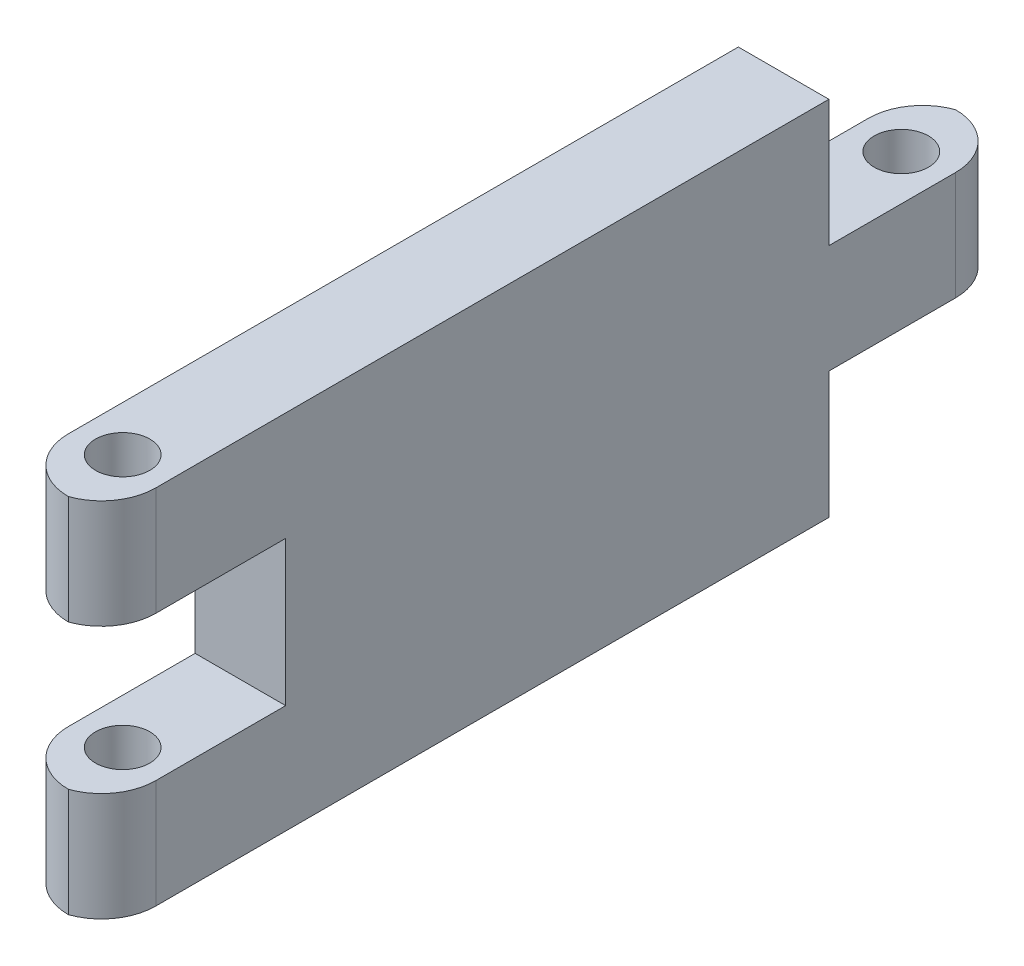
ISO-10303-21;
HEADER;
FILE_DESCRIPTION(('STEP AP214'),'2;1');
FILE_NAME('part.step','',(''),(''),'','','');
FILE_SCHEMA(('AUTOMOTIVE_DESIGN { 1 0 10303 214 1 1 1 1 }'));
ENDSEC;
DATA;
#1=APPLICATION_CONTEXT('core data for automotive mechanical design processes');
#2=APPLICATION_PROTOCOL_DEFINITION('international standard','automotive_design',2000,#1);
#3=PRODUCT_CONTEXT('',#1,'mechanical');
#4=PRODUCT('Part','Part','',(#3));
#5=PRODUCT_RELATED_PRODUCT_CATEGORY('part','',(#4));
#6=PRODUCT_DEFINITION_FORMATION('','',#4);
#7=PRODUCT_DEFINITION_CONTEXT('part definition',#1,'design');
#8=PRODUCT_DEFINITION('design','',#6,#7);
#9=PRODUCT_DEFINITION_SHAPE('','',#8);
#10=(LENGTH_UNIT() NAMED_UNIT(*) SI_UNIT(.MILLI.,.METRE.));
#11=(NAMED_UNIT(*) PLANE_ANGLE_UNIT() SI_UNIT($,.RADIAN.));
#12=(NAMED_UNIT(*) SI_UNIT($,.STERADIAN.) SOLID_ANGLE_UNIT());
#13=UNCERTAINTY_MEASURE_WITH_UNIT(LENGTH_MEASURE(1.E-05),#10,'distance_accuracy_value','');
#14=(GEOMETRIC_REPRESENTATION_CONTEXT(3) GLOBAL_UNCERTAINTY_ASSIGNED_CONTEXT((#13)) GLOBAL_UNIT_ASSIGNED_CONTEXT((#10,
#11,#12)) REPRESENTATION_CONTEXT('',''));
#15=CARTESIAN_POINT('',(0.,0.,0.));
#16=DIRECTION('',(0.,0.,1.));
#17=DIRECTION('',(1.,0.,0.));
#18=AXIS2_PLACEMENT_3D('',#15,#16,#17);
#19=CARTESIAN_POINT('',(5.,0.,-30.));
#20=DIRECTION('',(0.,0.,1.));
#21=DIRECTION('',(1.,0.,0.));
#22=AXIS2_PLACEMENT_3D('',#19,#20,#21);
#23=PLANE('',#22);
#24=DIRECTION('',(1.,0.,0.));
#25=VECTOR('',#24,1.);
#26=CARTESIAN_POINT('',(5.,13.,-30.));
#27=LINE('',#26,#25);
#28=CARTESIAN_POINT('',(0.,13.,-30.));
#29=VERTEX_POINT('',#28);
#30=CARTESIAN_POINT('',(5.,13.,-30.));
#31=VERTEX_POINT('',#30);
#32=EDGE_CURVE('E176',#29,#31,#27,.T.);
#33=ORIENTED_EDGE('',*,*,#32,.F.);
#34=DIRECTION('',(0.,1.,0.));
#35=VECTOR('',#34,1.);
#36=CARTESIAN_POINT('',(0.,0.,-30.));
#37=LINE('',#36,#35);
#38=CARTESIAN_POINT('',(0.,20.,-30.));
#39=VERTEX_POINT('',#38);
#40=EDGE_CURVE('E171',#29,#39,#37,.T.);
#41=ORIENTED_EDGE('',*,*,#40,.T.);
#42=DIRECTION('',(-1.,0.,0.));
#43=VECTOR('',#42,1.);
#44=CARTESIAN_POINT('',(5.,20.,-30.));
#45=LINE('',#44,#43);
#46=CARTESIAN_POINT('',(5.,20.,-30.));
#47=VERTEX_POINT('',#46);
#48=EDGE_CURVE('E242',#47,#39,#45,.T.);
#49=ORIENTED_EDGE('',*,*,#48,.F.);
#50=DIRECTION('',(0.,1.,0.));
#51=VECTOR('',#50,1.);
#52=CARTESIAN_POINT('',(5.,0.,-30.));
#53=LINE('',#52,#51);
#54=EDGE_CURVE('E234',#31,#47,#53,.T.);
#55=ORIENTED_EDGE('',*,*,#54,.F.);
#56=EDGE_LOOP('',(#33,#41,#49,#55));
#57=FACE_BOUND('',#56,.T.);
#58=ADVANCED_FACE('F43',(#57),#23,.F.);
#59=DIRECTION('',(-1.,0.,0.));
#60=VECTOR('',#59,1.);
#61=CARTESIAN_POINT('',(5.,7.,-30.));
#62=LINE('',#61,#60);
#63=CARTESIAN_POINT('',(5.,7.,-30.));
#64=VERTEX_POINT('',#63);
#65=CARTESIAN_POINT('',(0.,7.,-30.));
#66=VERTEX_POINT('',#65);
#67=EDGE_CURVE('E165',#64,#66,#62,.T.);
#68=ORIENTED_EDGE('',*,*,#67,.F.);
#69=CARTESIAN_POINT('',(5.,0.,-30.));
#70=VERTEX_POINT('',#69);
#71=EDGE_CURVE('E235',#70,#64,#53,.T.);
#72=ORIENTED_EDGE('',*,*,#71,.F.);
#73=DIRECTION('',(-1.,0.,0.));
#74=VECTOR('',#73,1.);
#75=CARTESIAN_POINT('',(5.,0.,-30.));
#76=LINE('',#75,#74);
#77=CARTESIAN_POINT('',(0.,0.,-30.));
#78=VERTEX_POINT('',#77);
#79=EDGE_CURVE('E168',#70,#78,#76,.T.);
#80=ORIENTED_EDGE('',*,*,#79,.T.);
#81=EDGE_CURVE('E152',#78,#66,#37,.T.);
#82=ORIENTED_EDGE('',*,*,#81,.T.);
#83=EDGE_LOOP('',(#68,#72,#80,#82));
#84=FACE_BOUND('',#83,.T.);
#85=ADVANCED_FACE('F163',(#84),#23,.F.);
#86=CARTESIAN_POINT('',(5.,0.,0.));
#87=DIRECTION('',(0.,0.,-1.));
#88=DIRECTION('',(-1.,0.,0.));
#89=AXIS2_PLACEMENT_3D('',#86,#87,#88);
#90=PLANE('',#89);
#91=DIRECTION('',(1.,0.,0.));
#92=VECTOR('',#91,1.);
#93=CARTESIAN_POINT('',(0.,14.,0.));
#94=LINE('',#93,#92);
#95=CARTESIAN_POINT('',(0.,14.,0.));
#96=VERTEX_POINT('',#95);
#97=CARTESIAN_POINT('',(5.,14.,0.));
#98=VERTEX_POINT('',#97);
#99=EDGE_CURVE('E206',#96,#98,#94,.T.);
#100=ORIENTED_EDGE('',*,*,#99,.F.);
#101=DIRECTION('',(0.,-1.,0.));
#102=VECTOR('',#101,1.);
#103=CARTESIAN_POINT('',(0.,0.,0.));
#104=LINE('',#103,#102);
#105=CARTESIAN_POINT('',(0.,6.,0.));
#106=VERTEX_POINT('',#105);
#107=EDGE_CURVE('E226',#96,#106,#104,.T.);
#108=ORIENTED_EDGE('',*,*,#107,.T.);
#109=DIRECTION('',(-1.,0.,0.));
#110=VECTOR('',#109,1.);
#111=CARTESIAN_POINT('',(0.,6.,0.));
#112=LINE('',#111,#110);
#113=CARTESIAN_POINT('',(5.,6.,0.));
#114=VERTEX_POINT('',#113);
#115=EDGE_CURVE('E216',#114,#106,#112,.T.);
#116=ORIENTED_EDGE('',*,*,#115,.F.);
#117=DIRECTION('',(0.,-1.,0.));
#118=VECTOR('',#117,1.);
#119=CARTESIAN_POINT('',(5.,0.,0.));
#120=LINE('',#119,#118);
#121=EDGE_CURVE('E227',#98,#114,#120,.T.);
#122=ORIENTED_EDGE('',*,*,#121,.F.);
#123=EDGE_LOOP('',(#100,#108,#116,#122));
#124=FACE_BOUND('',#123,.T.);
#125=ADVANCED_FACE('F355',(#124),#90,.F.);
#126=CARTESIAN_POINT('',(5.,0.,0.));
#127=DIRECTION('',(0.,1.,0.));
#128=DIRECTION('',(0.,0.,1.));
#129=AXIS2_PLACEMENT_3D('',#126,#127,#128);
#130=PLANE('',#129);
#131=CARTESIAN_POINT('',(2.5,0.,6.5));
#132=DIRECTION('',(0.,1.,0.));
#133=DIRECTION('',(0.,0.,1.));
#134=AXIS2_PLACEMENT_3D('',#131,#132,#133);
#135=CIRCLE('',#134,1.5);
#136=CARTESIAN_POINT('',(2.5,0.,8.));
#137=VERTEX_POINT('',#136);
#138=EDGE_CURVE('E193',#137,#137,#135,.T.);
#139=ORIENTED_EDGE('',*,*,#138,.T.);
#140=EDGE_LOOP('',(#139));
#141=FACE_BOUND('',#140,.T.);
#142=DIRECTION('',(0.,0.,-1.));
#143=VECTOR('',#142,1.);
#144=CARTESIAN_POINT('',(5.,0.,0.));
#145=LINE('',#144,#143);
#146=CARTESIAN_POINT('',(5.,0.,7.17157287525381));
#147=VERTEX_POINT('',#146);
#148=EDGE_CURVE('E231',#147,#70,#145,.T.);
#149=ORIENTED_EDGE('',*,*,#148,.F.);
#150=CARTESIAN_POINT('',(2.,0.,7.17157287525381));
#151=DIRECTION('',(0.,1.,0.));
#152=DIRECTION('',(0.,0.,1.));
#153=AXIS2_PLACEMENT_3D('',#150,#151,#152);
#154=CIRCLE('',#153,3.);
#155=CARTESIAN_POINT('',(3.,0.,10.));
#156=VERTEX_POINT('',#155);
#157=EDGE_CURVE('E277',#147,#156,#154,.F.);
#158=ORIENTED_EDGE('',*,*,#157,.T.);
#159=CARTESIAN_POINT('',(3.,0.,7.));
#160=DIRECTION('',(0.,1.,0.));
#161=DIRECTION('',(0.,0.,1.));
#162=AXIS2_PLACEMENT_3D('',#159,#160,#161);
#163=CIRCLE('',#162,3.);
#164=CARTESIAN_POINT('',(0.,0.,7.));
#165=VERTEX_POINT('',#164);
#166=EDGE_CURVE('E261',#156,#165,#163,.F.);
#167=ORIENTED_EDGE('',*,*,#166,.T.);
#168=DIRECTION('',(0.,0.,-1.));
#169=VECTOR('',#168,1.);
#170=CARTESIAN_POINT('',(0.,0.,0.));
#171=LINE('',#170,#169);
#172=EDGE_CURVE('E246',#165,#78,#171,.T.);
#173=ORIENTED_EDGE('',*,*,#172,.T.);
#174=ORIENTED_EDGE('',*,*,#79,.F.);
#175=EDGE_LOOP('',(#149,#158,#167,#173,#174));
#176=FACE_BOUND('',#175,.T.);
#177=ADVANCED_FACE('F368',(#141,#176),#130,.F.);
#178=CARTESIAN_POINT('',(5.,20.,0.));
#179=DIRECTION('',(0.,-1.,0.));
#180=DIRECTION('',(0.,0.,-1.));
#181=AXIS2_PLACEMENT_3D('',#178,#179,#180);
#182=PLANE('',#181);
#183=CARTESIAN_POINT('',(2.5,20.,6.5));
#184=DIRECTION('',(0.,-1.,0.));
#185=DIRECTION('',(0.,0.,-1.));
#186=AXIS2_PLACEMENT_3D('',#183,#184,#185);
#187=CIRCLE('',#186,1.5);
#188=CARTESIAN_POINT('',(2.5,20.,5.));
#189=VERTEX_POINT('',#188);
#190=EDGE_CURVE('E202',#189,#189,#187,.T.);
#191=ORIENTED_EDGE('',*,*,#190,.T.);
#192=EDGE_LOOP('',(#191));
#193=FACE_BOUND('',#192,.T.);
#194=CARTESIAN_POINT('',(3.,20.,7.));
#195=DIRECTION('',(0.,-1.,0.));
#196=DIRECTION('',(0.,0.,-1.));
#197=AXIS2_PLACEMENT_3D('',#194,#195,#196);
#198=CIRCLE('',#197,3.);
#199=CARTESIAN_POINT('',(0.,20.,7.));
#200=VERTEX_POINT('',#199);
#201=CARTESIAN_POINT('',(3.,20.,10.));
#202=VERTEX_POINT('',#201);
#203=EDGE_CURVE('E290',#200,#202,#198,.F.);
#204=ORIENTED_EDGE('',*,*,#203,.T.);
#205=CARTESIAN_POINT('',(2.,20.,7.17157287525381));
#206=DIRECTION('',(0.,-1.,0.));
#207=DIRECTION('',(0.,0.,-1.));
#208=AXIS2_PLACEMENT_3D('',#205,#206,#207);
#209=CIRCLE('',#208,3.);
#210=CARTESIAN_POINT('',(5.,20.,7.17157287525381));
#211=VERTEX_POINT('',#210);
#212=EDGE_CURVE('E300',#202,#211,#209,.F.);
#213=ORIENTED_EDGE('',*,*,#212,.T.);
#214=DIRECTION('',(0.,0.,1.));
#215=VECTOR('',#214,1.);
#216=CARTESIAN_POINT('',(5.,20.,0.));
#217=LINE('',#216,#215);
#218=EDGE_CURVE('E238',#47,#211,#217,.T.);
#219=ORIENTED_EDGE('',*,*,#218,.F.);
#220=ORIENTED_EDGE('',*,*,#48,.T.);
#221=DIRECTION('',(0.,0.,1.));
#222=VECTOR('',#221,1.);
#223=CARTESIAN_POINT('',(0.,20.,0.));
#224=LINE('',#223,#222);
#225=EDGE_CURVE('E170',#39,#200,#224,.T.);
#226=ORIENTED_EDGE('',*,*,#225,.T.);
#227=EDGE_LOOP('',(#204,#213,#219,#220,#226));
#228=FACE_BOUND('',#227,.T.);
#229=ADVANCED_FACE('F332',(#193,#228),#182,.F.);
#230=CARTESIAN_POINT('',(5.,0.,0.));
#231=DIRECTION('',(-1.,0.,0.));
#232=DIRECTION('',(0.,0.,1.));
#233=AXIS2_PLACEMENT_3D('',#230,#231,#232);
#234=PLANE('',#233);
#235=DIRECTION('',(0.,0.,1.));
#236=VECTOR('',#235,1.);
#237=CARTESIAN_POINT('',(5.,7.,-40.));
#238=LINE('',#237,#236);
#239=CARTESIAN_POINT('',(5.,7.,-37.));
#240=VERTEX_POINT('',#239);
#241=EDGE_CURVE('E157',#240,#64,#238,.T.);
#242=ORIENTED_EDGE('',*,*,#241,.F.);
#243=DIRECTION('',(0.,-1.,0.));
#244=VECTOR('',#243,1.);
#245=CARTESIAN_POINT('',(5.,13.,-37.));
#246=LINE('',#245,#244);
#247=CARTESIAN_POINT('',(5.,13.,-37.));
#248=VERTEX_POINT('',#247);
#249=EDGE_CURVE('E313',#240,#248,#246,.F.);
#250=ORIENTED_EDGE('',*,*,#249,.T.);
#251=DIRECTION('',(0.,0.,1.));
#252=VECTOR('',#251,1.);
#253=CARTESIAN_POINT('',(5.,13.,-40.));
#254=LINE('',#253,#252);
#255=EDGE_CURVE('E182',#248,#31,#254,.T.);
#256=ORIENTED_EDGE('',*,*,#255,.T.);
#257=ORIENTED_EDGE('',*,*,#54,.T.);
#258=ORIENTED_EDGE('',*,*,#218,.T.);
#259=DIRECTION('',(0.,-1.,0.));
#260=VECTOR('',#259,1.);
#261=CARTESIAN_POINT('',(5.,0.,7.17157287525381));
#262=LINE('',#261,#260);
#263=CARTESIAN_POINT('',(5.,14.,7.17157287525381));
#264=VERTEX_POINT('',#263);
#265=EDGE_CURVE('E293',#211,#264,#262,.T.);
#266=ORIENTED_EDGE('',*,*,#265,.T.);
#267=DIRECTION('',(0.,0.,-1.));
#268=VECTOR('',#267,1.);
#269=CARTESIAN_POINT('',(5.,14.,10.));
#270=LINE('',#269,#268);
#271=EDGE_CURVE('E213',#264,#98,#270,.T.);
#272=ORIENTED_EDGE('',*,*,#271,.T.);
#273=ORIENTED_EDGE('',*,*,#121,.T.);
#274=DIRECTION('',(0.,0.,-1.));
#275=VECTOR('',#274,1.);
#276=CARTESIAN_POINT('',(5.,6.,10.));
#277=LINE('',#276,#275);
#278=CARTESIAN_POINT('',(5.,6.,7.17157287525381));
#279=VERTEX_POINT('',#278);
#280=EDGE_CURVE('E223',#279,#114,#277,.T.);
#281=ORIENTED_EDGE('',*,*,#280,.F.);
#282=DIRECTION('',(0.,-1.,0.));
#283=VECTOR('',#282,1.);
#284=CARTESIAN_POINT('',(5.,0.,7.17157287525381));
#285=LINE('',#284,#283);
#286=EDGE_CURVE('E274',#279,#147,#285,.T.);
#287=ORIENTED_EDGE('',*,*,#286,.T.);
#288=ORIENTED_EDGE('',*,*,#148,.T.);
#289=ORIENTED_EDGE('',*,*,#71,.T.);
#290=EDGE_LOOP('',(#242,#250,#256,#257,#258,#266,#272,#273,#281,#287,#288,#289));
#291=FACE_BOUND('',#290,.T.);
#292=ADVANCED_FACE('F345',(#291),#234,.F.);
#293=CARTESIAN_POINT('',(0.,0.,0.));
#294=DIRECTION('',(-1.,0.,0.));
#295=DIRECTION('',(0.,0.,1.));
#296=AXIS2_PLACEMENT_3D('',#293,#294,#295);
#297=PLANE('',#296);
#298=DIRECTION('',(0.,0.,1.));
#299=VECTOR('',#298,1.);
#300=CARTESIAN_POINT('',(0.,13.,-40.));
#301=LINE('',#300,#299);
#302=CARTESIAN_POINT('',(0.,13.,-37.1715728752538));
#303=VERTEX_POINT('',#302);
#304=EDGE_CURVE('E158',#303,#29,#301,.T.);
#305=ORIENTED_EDGE('',*,*,#304,.F.);
#306=DIRECTION('',(0.,1.,0.));
#307=VECTOR('',#306,1.);
#308=CARTESIAN_POINT('',(0.,7.,-37.1715728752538));
#309=LINE('',#308,#307);
#310=CARTESIAN_POINT('',(0.,7.,-37.1715728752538));
#311=VERTEX_POINT('',#310);
#312=EDGE_CURVE('E53',#303,#311,#309,.F.);
#313=ORIENTED_EDGE('',*,*,#312,.T.);
#314=DIRECTION('',(0.,0.,1.));
#315=VECTOR('',#314,1.);
#316=CARTESIAN_POINT('',(0.,7.,-40.));
#317=LINE('',#316,#315);
#318=EDGE_CURVE('E148',#311,#66,#317,.T.);
#319=ORIENTED_EDGE('',*,*,#318,.T.);
#320=ORIENTED_EDGE('',*,*,#81,.F.);
#321=ORIENTED_EDGE('',*,*,#172,.F.);
#322=DIRECTION('',(0.,-1.,0.));
#323=VECTOR('',#322,1.);
#324=CARTESIAN_POINT('',(0.,6.,7.));
#325=LINE('',#324,#323);
#326=CARTESIAN_POINT('',(0.,6.,7.));
#327=VERTEX_POINT('',#326);
#328=EDGE_CURVE('E264',#165,#327,#325,.F.);
#329=ORIENTED_EDGE('',*,*,#328,.T.);
#330=DIRECTION('',(0.,0.,-1.));
#331=VECTOR('',#330,1.);
#332=CARTESIAN_POINT('',(0.,6.,10.));
#333=LINE('',#332,#331);
#334=EDGE_CURVE('E220',#327,#106,#333,.T.);
#335=ORIENTED_EDGE('',*,*,#334,.T.);
#336=ORIENTED_EDGE('',*,*,#107,.F.);
#337=DIRECTION('',(0.,0.,-1.));
#338=VECTOR('',#337,1.);
#339=CARTESIAN_POINT('',(0.,14.,10.));
#340=LINE('',#339,#338);
#341=CARTESIAN_POINT('',(0.,14.,7.));
#342=VERTEX_POINT('',#341);
#343=EDGE_CURVE('E210',#342,#96,#340,.T.);
#344=ORIENTED_EDGE('',*,*,#343,.F.);
#345=DIRECTION('',(0.,-1.,0.));
#346=VECTOR('',#345,1.);
#347=CARTESIAN_POINT('',(0.,20.,7.));
#348=LINE('',#347,#346);
#349=EDGE_CURVE('E287',#342,#200,#348,.F.);
#350=ORIENTED_EDGE('',*,*,#349,.T.);
#351=ORIENTED_EDGE('',*,*,#225,.F.);
#352=ORIENTED_EDGE('',*,*,#40,.F.);
#353=EDGE_LOOP('',(#305,#313,#319,#320,#321,#329,#335,#336,#344,#350,#351,#352));
#354=FACE_BOUND('',#353,.T.);
#355=ADVANCED_FACE('F150',(#354),#297,.T.);
#356=CARTESIAN_POINT('',(0.,6.,10.));
#357=DIRECTION('',(0.,-1.,0.));
#358=DIRECTION('',(0.,0.,-1.));
#359=AXIS2_PLACEMENT_3D('',#356,#357,#358);
#360=PLANE('',#359);
#361=CARTESIAN_POINT('',(2.5,6.,6.5));
#362=DIRECTION('',(0.,-1.,0.));
#363=DIRECTION('',(0.,0.,-1.));
#364=AXIS2_PLACEMENT_3D('',#361,#362,#363);
#365=CIRCLE('',#364,1.5);
#366=CARTESIAN_POINT('',(2.5,6.,5.));
#367=VERTEX_POINT('',#366);
#368=EDGE_CURVE('E198',#367,#367,#365,.T.);
#369=ORIENTED_EDGE('',*,*,#368,.T.);
#370=EDGE_LOOP('',(#369));
#371=FACE_BOUND('',#370,.T.);
#372=CARTESIAN_POINT('',(3.,6.,7.));
#373=DIRECTION('',(0.,-1.,0.));
#374=DIRECTION('',(0.,0.,-1.));
#375=AXIS2_PLACEMENT_3D('',#372,#373,#374);
#376=CIRCLE('',#375,3.);
#377=CARTESIAN_POINT('',(3.,6.,10.));
#378=VERTEX_POINT('',#377);
#379=EDGE_CURVE('E267',#327,#378,#376,.F.);
#380=ORIENTED_EDGE('',*,*,#379,.T.);
#381=CARTESIAN_POINT('',(2.,6.,7.17157287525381));
#382=DIRECTION('',(0.,-1.,0.));
#383=DIRECTION('',(0.,0.,-1.));
#384=AXIS2_PLACEMENT_3D('',#381,#382,#383);
#385=CIRCLE('',#384,3.);
#386=EDGE_CURVE('E271',#378,#279,#385,.F.);
#387=ORIENTED_EDGE('',*,*,#386,.T.);
#388=ORIENTED_EDGE('',*,*,#280,.T.);
#389=ORIENTED_EDGE('',*,*,#115,.T.);
#390=ORIENTED_EDGE('',*,*,#334,.F.);
#391=EDGE_LOOP('',(#380,#387,#388,#389,#390));
#392=FACE_BOUND('',#391,.T.);
#393=ADVANCED_FACE('F358',(#371,#392),#360,.F.);
#394=CARTESIAN_POINT('',(0.,14.,10.));
#395=DIRECTION('',(0.,1.,0.));
#396=DIRECTION('',(0.,0.,1.));
#397=AXIS2_PLACEMENT_3D('',#394,#395,#396);
#398=PLANE('',#397);
#399=CARTESIAN_POINT('',(2.5,14.,6.5));
#400=DIRECTION('',(0.,1.,0.));
#401=DIRECTION('',(0.,0.,1.));
#402=AXIS2_PLACEMENT_3D('',#399,#400,#401);
#403=CIRCLE('',#402,1.5);
#404=CARTESIAN_POINT('',(2.5,14.,8.));
#405=VERTEX_POINT('',#404);
#406=EDGE_CURVE('E197',#405,#405,#403,.T.);
#407=ORIENTED_EDGE('',*,*,#406,.T.);
#408=EDGE_LOOP('',(#407));
#409=FACE_BOUND('',#408,.T.);
#410=ORIENTED_EDGE('',*,*,#271,.F.);
#411=CARTESIAN_POINT('',(2.,14.,7.17157287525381));
#412=DIRECTION('',(0.,1.,0.));
#413=DIRECTION('',(0.,0.,1.));
#414=AXIS2_PLACEMENT_3D('',#411,#412,#413);
#415=CIRCLE('',#414,3.);
#416=CARTESIAN_POINT('',(3.,14.,10.));
#417=VERTEX_POINT('',#416);
#418=EDGE_CURVE('E297',#264,#417,#415,.F.);
#419=ORIENTED_EDGE('',*,*,#418,.T.);
#420=CARTESIAN_POINT('',(3.,14.,7.));
#421=DIRECTION('',(0.,1.,0.));
#422=DIRECTION('',(0.,0.,1.));
#423=AXIS2_PLACEMENT_3D('',#420,#421,#422);
#424=CIRCLE('',#423,3.);
#425=EDGE_CURVE('E284',#417,#342,#424,.F.);
#426=ORIENTED_EDGE('',*,*,#425,.T.);
#427=ORIENTED_EDGE('',*,*,#343,.T.);
#428=ORIENTED_EDGE('',*,*,#99,.T.);
#429=EDGE_LOOP('',(#410,#419,#426,#427,#428));
#430=FACE_BOUND('',#429,.T.);
#431=ADVANCED_FACE('F349',(#409,#430),#398,.F.);
#432=CARTESIAN_POINT('',(3.,0.,7.));
#433=DIRECTION('',(0.,1.,0.));
#434=DIRECTION('',(0.,0.,1.));
#435=AXIS2_PLACEMENT_3D('',#432,#433,#434);
#436=CYLINDRICAL_SURFACE('',#435,3.);
#437=ORIENTED_EDGE('',*,*,#379,.F.);
#438=ORIENTED_EDGE('',*,*,#328,.F.);
#439=ORIENTED_EDGE('',*,*,#166,.F.);
#440=DIRECTION('',(0.,-1.,0.));
#441=VECTOR('',#440,1.);
#442=CARTESIAN_POINT('',(3.,0.,10.));
#443=LINE('',#442,#441);
#444=EDGE_CURVE('E257',#378,#156,#443,.T.);
#445=ORIENTED_EDGE('',*,*,#444,.F.);
#446=EDGE_LOOP('',(#437,#438,#439,#445));
#447=FACE_BOUND('',#446,.T.);
#448=ADVANCED_FACE('F371',(#447),#436,.T.);
#449=CARTESIAN_POINT('',(2.,0.,7.17157287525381));
#450=DIRECTION('',(0.,-1.,0.));
#451=DIRECTION('',(0.,0.,-1.));
#452=AXIS2_PLACEMENT_3D('',#449,#450,#451);
#453=CYLINDRICAL_SURFACE('',#452,3.);
#454=ORIENTED_EDGE('',*,*,#157,.F.);
#455=ORIENTED_EDGE('',*,*,#286,.F.);
#456=ORIENTED_EDGE('',*,*,#386,.F.);
#457=ORIENTED_EDGE('',*,*,#444,.T.);
#458=EDGE_LOOP('',(#454,#455,#456,#457));
#459=FACE_BOUND('',#458,.T.);
#460=ADVANCED_FACE('F364',(#459),#453,.T.);
#461=CARTESIAN_POINT('',(3.,0.,7.));
#462=DIRECTION('',(0.,1.,0.));
#463=DIRECTION('',(0.,0.,1.));
#464=AXIS2_PLACEMENT_3D('',#461,#462,#463);
#465=CYLINDRICAL_SURFACE('',#464,3.);
#466=ORIENTED_EDGE('',*,*,#203,.F.);
#467=ORIENTED_EDGE('',*,*,#349,.F.);
#468=ORIENTED_EDGE('',*,*,#425,.F.);
#469=DIRECTION('',(0.,-1.,0.));
#470=VECTOR('',#469,1.);
#471=CARTESIAN_POINT('',(3.,14.,10.));
#472=LINE('',#471,#470);
#473=EDGE_CURVE('E280',#202,#417,#472,.T.);
#474=ORIENTED_EDGE('',*,*,#473,.F.);
#475=EDGE_LOOP('',(#466,#467,#468,#474));
#476=FACE_BOUND('',#475,.T.);
#477=ADVANCED_FACE('F339',(#476),#465,.T.);
#478=CARTESIAN_POINT('',(2.,0.,7.17157287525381));
#479=DIRECTION('',(0.,-1.,0.));
#480=DIRECTION('',(0.,0.,-1.));
#481=AXIS2_PLACEMENT_3D('',#478,#479,#480);
#482=CYLINDRICAL_SURFACE('',#481,3.);
#483=ORIENTED_EDGE('',*,*,#212,.F.);
#484=ORIENTED_EDGE('',*,*,#473,.T.);
#485=ORIENTED_EDGE('',*,*,#418,.F.);
#486=ORIENTED_EDGE('',*,*,#265,.F.);
#487=EDGE_LOOP('',(#483,#484,#485,#486));
#488=FACE_BOUND('',#487,.T.);
#489=ADVANCED_FACE('F347',(#488),#482,.T.);
#490=CARTESIAN_POINT('',(2.5,0.,6.5));
#491=DIRECTION('',(0.,1.,0.));
#492=DIRECTION('',(0.,0.,1.));
#493=AXIS2_PLACEMENT_3D('',#490,#491,#492);
#494=CYLINDRICAL_SURFACE('',#493,1.5);
#495=ORIENTED_EDGE('',*,*,#406,.F.);
#496=EDGE_LOOP('',(#495));
#497=FACE_BOUND('',#496,.T.);
#498=ORIENTED_EDGE('',*,*,#190,.F.);
#499=EDGE_LOOP('',(#498));
#500=FACE_BOUND('',#499,.T.);
#501=ADVANCED_FACE('F410',(#497,#500),#494,.F.);
#502=ORIENTED_EDGE('',*,*,#138,.F.);
#503=EDGE_LOOP('',(#502));
#504=FACE_BOUND('',#503,.T.);
#505=ORIENTED_EDGE('',*,*,#368,.F.);
#506=EDGE_LOOP('',(#505));
#507=FACE_BOUND('',#506,.T.);
#508=ADVANCED_FACE('F414',(#504,#507),#494,.F.);
#509=CARTESIAN_POINT('',(5.,7.,-40.));
#510=DIRECTION('',(0.,1.,0.));
#511=DIRECTION('',(0.,0.,1.));
#512=AXIS2_PLACEMENT_3D('',#509,#510,#511);
#513=PLANE('',#512);
#514=CARTESIAN_POINT('',(2.5,7.,-36.5));
#515=DIRECTION('',(0.,1.,0.));
#516=DIRECTION('',(0.,0.,1.));
#517=AXIS2_PLACEMENT_3D('',#514,#515,#516);
#518=CIRCLE('',#517,1.5);
#519=CARTESIAN_POINT('',(2.5,7.,-38.));
#520=VERTEX_POINT('',#519);
#521=EDGE_CURVE('E177',#520,#520,#518,.T.);
#522=ORIENTED_EDGE('',*,*,#521,.T.);
#523=EDGE_LOOP('',(#522));
#524=FACE_BOUND('',#523,.T.);
#525=ORIENTED_EDGE('',*,*,#318,.F.);
#526=CARTESIAN_POINT('',(3.,7.,-37.1715728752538));
#527=DIRECTION('',(0.,1.,0.));
#528=DIRECTION('',(0.,0.,1.));
#529=AXIS2_PLACEMENT_3D('',#526,#527,#528);
#530=CIRCLE('',#529,3.);
#531=CARTESIAN_POINT('',(2.,7.,-40.));
#532=VERTEX_POINT('',#531);
#533=EDGE_CURVE('E11',#311,#532,#530,.F.);
#534=ORIENTED_EDGE('',*,*,#533,.T.);
#535=CARTESIAN_POINT('',(2.,7.,-37.));
#536=DIRECTION('',(0.,1.,0.));
#537=DIRECTION('',(0.,0.,1.));
#538=AXIS2_PLACEMENT_3D('',#535,#536,#537);
#539=CIRCLE('',#538,3.);
#540=EDGE_CURVE('E310',#532,#240,#539,.F.);
#541=ORIENTED_EDGE('',*,*,#540,.T.);
#542=ORIENTED_EDGE('',*,*,#241,.T.);
#543=ORIENTED_EDGE('',*,*,#67,.T.);
#544=EDGE_LOOP('',(#525,#534,#541,#542,#543));
#545=FACE_BOUND('',#544,.T.);
#546=ADVANCED_FACE('F173',(#524,#545),#513,.F.);
#547=CARTESIAN_POINT('',(5.,13.,-40.));
#548=DIRECTION('',(0.,-1.,0.));
#549=DIRECTION('',(0.,0.,-1.));
#550=AXIS2_PLACEMENT_3D('',#547,#548,#549);
#551=PLANE('',#550);
#552=CARTESIAN_POINT('',(2.5,13.,-36.5));
#553=DIRECTION('',(0.,-1.,0.));
#554=DIRECTION('',(0.,0.,-1.));
#555=AXIS2_PLACEMENT_3D('',#552,#553,#554);
#556=CIRCLE('',#555,1.5);
#557=CARTESIAN_POINT('',(2.5,13.,-38.));
#558=VERTEX_POINT('',#557);
#559=EDGE_CURVE('E47',#558,#558,#556,.T.);
#560=ORIENTED_EDGE('',*,*,#559,.T.);
#561=EDGE_LOOP('',(#560));
#562=FACE_BOUND('',#561,.T.);
#563=CARTESIAN_POINT('',(2.,13.,-37.));
#564=DIRECTION('',(0.,-1.,0.));
#565=DIRECTION('',(0.,0.,-1.));
#566=AXIS2_PLACEMENT_3D('',#563,#564,#565);
#567=CIRCLE('',#566,3.);
#568=CARTESIAN_POINT('',(2.,13.,-40.));
#569=VERTEX_POINT('',#568);
#570=EDGE_CURVE('E316',#248,#569,#567,.F.);
#571=ORIENTED_EDGE('',*,*,#570,.T.);
#572=CARTESIAN_POINT('',(3.,13.,-37.1715728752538));
#573=DIRECTION('',(0.,-1.,0.));
#574=DIRECTION('',(0.,0.,-1.));
#575=AXIS2_PLACEMENT_3D('',#572,#573,#574);
#576=CIRCLE('',#575,3.);
#577=EDGE_CURVE('E67',#569,#303,#576,.F.);
#578=ORIENTED_EDGE('',*,*,#577,.T.);
#579=ORIENTED_EDGE('',*,*,#304,.T.);
#580=ORIENTED_EDGE('',*,*,#32,.T.);
#581=ORIENTED_EDGE('',*,*,#255,.F.);
#582=EDGE_LOOP('',(#571,#578,#579,#580,#581));
#583=FACE_BOUND('',#582,.T.);
#584=ADVANCED_FACE('F379',(#562,#583),#551,.F.);
#585=CARTESIAN_POINT('',(2.,0.,-37.));
#586=DIRECTION('',(0.,1.,0.));
#587=DIRECTION('',(0.,0.,1.));
#588=AXIS2_PLACEMENT_3D('',#585,#586,#587);
#589=CYLINDRICAL_SURFACE('',#588,3.);
#590=ORIENTED_EDGE('',*,*,#570,.F.);
#591=ORIENTED_EDGE('',*,*,#249,.F.);
#592=ORIENTED_EDGE('',*,*,#540,.F.);
#593=DIRECTION('',(0.,-1.,0.));
#594=VECTOR('',#593,1.);
#595=CARTESIAN_POINT('',(2.,7.,-40.));
#596=LINE('',#595,#594);
#597=EDGE_CURVE('E303',#569,#532,#596,.T.);
#598=ORIENTED_EDGE('',*,*,#597,.F.);
#599=EDGE_LOOP('',(#590,#591,#592,#598));
#600=FACE_BOUND('',#599,.T.);
#601=ADVANCED_FACE('F377',(#600),#589,.T.);
#602=CARTESIAN_POINT('',(3.,0.,-37.1715728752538));
#603=DIRECTION('',(0.,-1.,0.));
#604=DIRECTION('',(0.,0.,-1.));
#605=AXIS2_PLACEMENT_3D('',#602,#603,#604);
#606=CYLINDRICAL_SURFACE('',#605,3.);
#607=ORIENTED_EDGE('',*,*,#533,.F.);
#608=ORIENTED_EDGE('',*,*,#312,.F.);
#609=ORIENTED_EDGE('',*,*,#577,.F.);
#610=ORIENTED_EDGE('',*,*,#597,.T.);
#611=EDGE_LOOP('',(#607,#608,#609,#610));
#612=FACE_BOUND('',#611,.T.);
#613=ADVANCED_FACE('F45',(#612),#606,.T.);
#614=CARTESIAN_POINT('',(2.5,20.,-36.5));
#615=DIRECTION('',(0.,-1.,0.));
#616=DIRECTION('',(0.,0.,-1.));
#617=AXIS2_PLACEMENT_3D('',#614,#615,#616);
#618=CYLINDRICAL_SURFACE('',#617,1.5);
#619=CARTESIAN_POINT('',(2.5,13.,-38.));
#620=CARTESIAN_POINT('',(2.5,12.9375,-38.));
#621=CARTESIAN_POINT('',(2.5,12.875,-38.));
#622=CARTESIAN_POINT('',(2.5,12.75,-38.));
#623=CARTESIAN_POINT('',(2.5,12.6875,-38.));
#624=CARTESIAN_POINT('',(2.5,12.5625,-38.));
#625=CARTESIAN_POINT('',(2.5,12.5,-38.));
#626=CARTESIAN_POINT('',(2.5,12.375,-38.));
#627=CARTESIAN_POINT('',(2.5,12.3125,-38.));
#628=CARTESIAN_POINT('',(2.5,12.1875,-38.));
#629=CARTESIAN_POINT('',(2.5,12.125,-38.));
#630=CARTESIAN_POINT('',(2.5,12.,-38.));
#631=CARTESIAN_POINT('',(2.5,11.9375,-38.));
#632=CARTESIAN_POINT('',(2.5,11.8125,-38.));
#633=CARTESIAN_POINT('',(2.5,11.75,-38.));
#634=CARTESIAN_POINT('',(2.5,11.625,-38.));
#635=CARTESIAN_POINT('',(2.5,11.5625,-38.));
#636=CARTESIAN_POINT('',(2.5,11.4375,-38.));
#637=CARTESIAN_POINT('',(2.5,11.375,-38.));
#638=CARTESIAN_POINT('',(2.5,11.25,-38.));
#639=CARTESIAN_POINT('',(2.5,11.1875,-38.));
#640=CARTESIAN_POINT('',(2.5,11.0625,-38.));
#641=CARTESIAN_POINT('',(2.5,11.,-38.));
#642=CARTESIAN_POINT('',(2.5,10.875,-38.));
#643=CARTESIAN_POINT('',(2.5,10.8125,-38.));
#644=CARTESIAN_POINT('',(2.5,10.6875,-38.));
#645=CARTESIAN_POINT('',(2.5,10.625,-38.));
#646=CARTESIAN_POINT('',(2.5,10.5,-38.));
#647=CARTESIAN_POINT('',(2.5,10.4375,-38.));
#648=CARTESIAN_POINT('',(2.5,10.3125,-38.));
#649=CARTESIAN_POINT('',(2.5,10.25,-38.));
#650=CARTESIAN_POINT('',(2.5,10.125,-38.));
#651=CARTESIAN_POINT('',(2.5,10.0625,-38.));
#652=CARTESIAN_POINT('',(2.5,9.9375,-38.));
#653=CARTESIAN_POINT('',(2.5,9.875,-38.));
#654=CARTESIAN_POINT('',(2.5,9.75,-38.));
#655=CARTESIAN_POINT('',(2.5,9.6875,-38.));
#656=CARTESIAN_POINT('',(2.5,9.5625,-38.));
#657=CARTESIAN_POINT('',(2.5,9.5,-38.));
#658=CARTESIAN_POINT('',(2.5,9.375,-38.));
#659=CARTESIAN_POINT('',(2.5,9.3125,-38.));
#660=CARTESIAN_POINT('',(2.5,9.1875,-38.));
#661=CARTESIAN_POINT('',(2.5,9.125,-38.));
#662=CARTESIAN_POINT('',(2.5,9.,-38.));
#663=CARTESIAN_POINT('',(2.5,8.9375,-38.));
#664=CARTESIAN_POINT('',(2.5,8.8125,-38.));
#665=CARTESIAN_POINT('',(2.5,8.75,-38.));
#666=CARTESIAN_POINT('',(2.5,8.625,-38.));
#667=CARTESIAN_POINT('',(2.5,8.5625,-38.));
#668=CARTESIAN_POINT('',(2.5,8.4375,-38.));
#669=CARTESIAN_POINT('',(2.5,8.375,-38.));
#670=CARTESIAN_POINT('',(2.5,8.25,-38.));
#671=CARTESIAN_POINT('',(2.5,8.1875,-38.));
#672=CARTESIAN_POINT('',(2.5,8.0625,-38.));
#673=CARTESIAN_POINT('',(2.5,8.,-38.));
#674=CARTESIAN_POINT('',(2.5,7.875,-38.));
#675=CARTESIAN_POINT('',(2.5,7.8125,-38.));
#676=CARTESIAN_POINT('',(2.5,7.6875,-38.));
#677=CARTESIAN_POINT('',(2.5,7.625,-38.));
#678=CARTESIAN_POINT('',(2.5,7.5,-38.));
#679=CARTESIAN_POINT('',(2.5,7.4375,-38.));
#680=CARTESIAN_POINT('',(2.5,7.3125,-38.));
#681=CARTESIAN_POINT('',(2.5,7.25,-38.));
#682=CARTESIAN_POINT('',(2.5,7.125,-38.));
#683=CARTESIAN_POINT('',(2.5,7.0625,-38.));
#684=CARTESIAN_POINT('',(2.5,7.,-38.));
#685=B_SPLINE_CURVE_WITH_KNOTS('',3,(#619,#620,#621,#622,#623,#624,#625,#626,#627,#628,#629,
#630,#631,#632,#633,#634,#635,#636,#637,#638,#639,#640,#641,#642,#643,#644,#645,#646,#647,#648,
#649,#650,#651,#652,#653,#654,#655,#656,#657,#658,#659,#660,#661,#662,#663,#664,#665,#666,#667,
#668,#669,#670,#671,#672,#673,#674,#675,#676,#677,#678,#679,#680,#681,#682,#683,#684),
.UNSPECIFIED.,.F.,.F.,(4,2,2,2,2,2,2,2,2,2,2,2,2,2,2,2,2,2,2,2,2,2,2,2,2,2,2,2,2,2,2,2,4),(0.,
0.1875,0.375,0.5625,0.750000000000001,0.937499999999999,1.125,1.3125,1.5,1.6875,1.875,2.0625,
2.25,2.4375,2.625,2.8125,3.,3.1875,3.375,3.5625,3.75,3.9375,4.125,4.3125,4.5,4.6875,4.875,
5.0625,5.25,5.4375,5.625,5.8125,6.),.UNSPECIFIED.);
#686=EDGE_CURVE('BSEAM382',#558,#520,#685,.T.);
#687=ORIENTED_EDGE('',*,*,#559,.F.);
#688=ORIENTED_EDGE('',*,*,#521,.F.);
#689=ORIENTED_EDGE('',*,*,#686,.T.);
#690=ORIENTED_EDGE('',*,*,#686,.F.);
#691=EDGE_LOOP('',(#687,#689,#688,#690));
#692=FACE_BOUND('',#691,.T.);
#693=ADVANCED_FACE('F382',(#692),#618,.F.);
#694=CLOSED_SHELL('',(#58,#85,#125,#177,#229,#292,#355,#393,#431,#448,#460,#477,#489,#501,#508,
#546,#584,#601,#613,#693));
#695=MANIFOLD_SOLID_BREP('B2',#694);
#696=ADVANCED_BREP_SHAPE_REPRESENTATION('',(#18,#695),#14);
#697=SHAPE_DEFINITION_REPRESENTATION(#9,#696);
ENDSEC;
END-ISO-10303-21;
